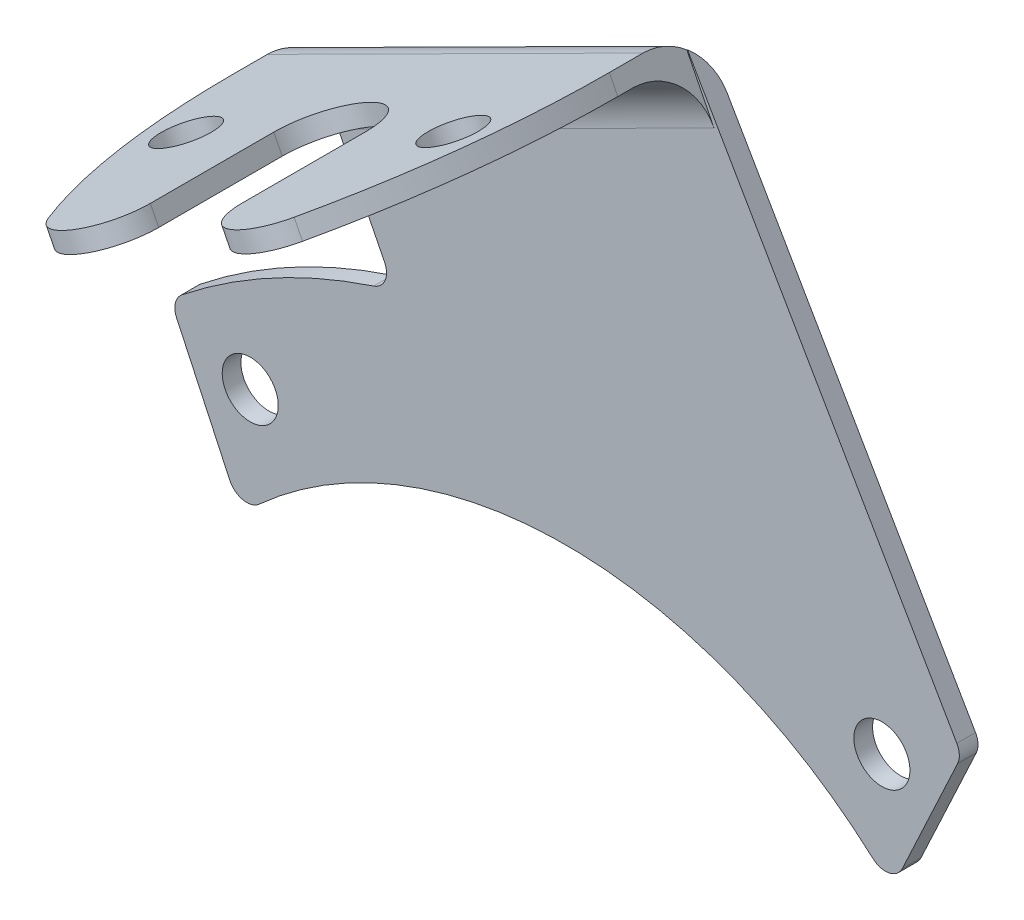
ISO-10303-21;
HEADER;
FILE_DESCRIPTION(('STEP AP214'),'2;1');
FILE_NAME('part.step','',(''),(''),'','','');
FILE_SCHEMA(('AUTOMOTIVE_DESIGN { 1 0 10303 214 1 1 1 1 }'));
ENDSEC;
DATA;
#1=APPLICATION_CONTEXT('core data for automotive mechanical design processes');
#2=APPLICATION_PROTOCOL_DEFINITION('international standard','automotive_design',2000,#1);
#3=PRODUCT_CONTEXT('',#1,'mechanical');
#4=PRODUCT('Part','Part','',(#3));
#5=PRODUCT_RELATED_PRODUCT_CATEGORY('part','',(#4));
#6=PRODUCT_DEFINITION_FORMATION('','',#4);
#7=PRODUCT_DEFINITION_CONTEXT('part definition',#1,'design');
#8=PRODUCT_DEFINITION('design','',#6,#7);
#9=PRODUCT_DEFINITION_SHAPE('','',#8);
#10=(LENGTH_UNIT() NAMED_UNIT(*) SI_UNIT(.MILLI.,.METRE.));
#11=(NAMED_UNIT(*) PLANE_ANGLE_UNIT() SI_UNIT($,.RADIAN.));
#12=(NAMED_UNIT(*) SI_UNIT($,.STERADIAN.) SOLID_ANGLE_UNIT());
#13=UNCERTAINTY_MEASURE_WITH_UNIT(LENGTH_MEASURE(1.E-05),#10,'distance_accuracy_value','');
#14=(GEOMETRIC_REPRESENTATION_CONTEXT(3) GLOBAL_UNCERTAINTY_ASSIGNED_CONTEXT((#13)) GLOBAL_UNIT_ASSIGNED_CONTEXT((#10,
#11,#12)) REPRESENTATION_CONTEXT('',''));
#15=CARTESIAN_POINT('',(0.,0.,0.));
#16=DIRECTION('',(0.,0.,1.));
#17=DIRECTION('',(1.,0.,0.));
#18=AXIS2_PLACEMENT_3D('',#15,#16,#17);
#19=CARTESIAN_POINT('',(-21.2075310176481,64.6083634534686,2.));
#20=DIRECTION('',(0.,0.,1.));
#21=DIRECTION('',(1.,0.,0.));
#22=AXIS2_PLACEMENT_3D('',#19,#20,#21);
#23=PLANE('',#22);
#24=DIRECTION('',(-0.500390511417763,0.865799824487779,0.));
#25=VECTOR('',#24,1.);
#26=CARTESIAN_POINT('',(41.8150128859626,51.534310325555,2.));
#27=LINE('',#26,#25);
#28=CARTESIAN_POINT('',(41.8150128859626,51.534310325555,2.));
#29=VERTEX_POINT('',#28);
#30=CARTESIAN_POINT('',(13.0019709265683,101.388026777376,2.));
#31=VERTEX_POINT('',#30);
#32=EDGE_CURVE('E689',#29,#31,#27,.T.);
#33=ORIENTED_EDGE('',*,*,#32,.T.);
#34=DIRECTION('',(-0.893343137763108,-0.449375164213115,0.));
#35=VECTOR('',#34,1.);
#36=CARTESIAN_POINT('',(13.0019709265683,101.388026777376,2.));
#37=LINE('',#36,#35);
#38=CARTESIAN_POINT('',(12.9227393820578,101.348171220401,2.));
#39=VERTEX_POINT('',#38);
#40=EDGE_CURVE('E756',#31,#39,#37,.T.);
#41=ORIENTED_EDGE('',*,*,#40,.T.);
#42=DIRECTION('',(-0.449375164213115,0.893343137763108,0.));
#43=VECTOR('',#42,1.);
#44=CARTESIAN_POINT('',(13.1349055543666,100.926391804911,2.));
#45=LINE('',#44,#43);
#46=CARTESIAN_POINT('',(15.8311565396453,95.566332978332,2.));
#47=VERTEX_POINT('',#46);
#48=EDGE_CURVE('E391',#47,#39,#45,.T.);
#49=ORIENTED_EDGE('',*,*,#48,.F.);
#50=DIRECTION('',(-0.893343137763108,-0.449375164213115,0.));
#51=VECTOR('',#50,1.);
#52=CARTESIAN_POINT('',(-26.1559709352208,74.4457002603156,2.));
#53=LINE('',#52,#51);
#54=CARTESIAN_POINT('',(-24.3692846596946,75.3444505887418,2.));
#55=VERTEX_POINT('',#54);
#56=EDGE_CURVE('E765',#47,#55,#53,.T.);
#57=ORIENTED_EDGE('',*,*,#56,.T.);
#58=DIRECTION('',(0.449375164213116,-0.893343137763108,0.));
#59=VECTOR('',#58,1.);
#60=CARTESIAN_POINT('',(-27.9642859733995,82.4911956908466,2.));
#61=LINE('',#60,#59);
#62=CARTESIAN_POINT('',(-19.4208447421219,65.5071137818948,2.));
#63=VERTEX_POINT('',#62);
#64=EDGE_CURVE('E646',#55,#63,#61,.T.);
#65=ORIENTED_EDGE('',*,*,#64,.T.);
#66=CARTESIAN_POINT('',(-21.2075310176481,64.6083634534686,2.));
#67=DIRECTION('',(0.,0.,-1.));
#68=DIRECTION('',(1.,0.,0.));
#69=AXIS2_PLACEMENT_3D('',#66,#67,#68);
#70=CIRCLE('',#69,2.00000000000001);
#71=CARTESIAN_POINT('',(-20.5837801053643,62.708117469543,2.));
#72=VERTEX_POINT('',#71);
#73=EDGE_CURVE('E649',#63,#72,#70,.T.);
#74=ORIENTED_EDGE('',*,*,#73,.T.);
#75=CARTESIAN_POINT('',(0.,0.,2.));
#76=DIRECTION('',(0.,0.,1.));
#77=DIRECTION('',(-1.,0.,0.));
#78=AXIS2_PLACEMENT_3D('',#75,#76,#77);
#79=CIRCLE('',#78,66.);
#80=CARTESIAN_POINT('',(-41.1117039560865,51.6316549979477,2.));
#81=VERTEX_POINT('',#80);
#82=EDGE_CURVE('E705',#72,#81,#79,.T.);
#83=ORIENTED_EDGE('',*,*,#82,.T.);
#84=CARTESIAN_POINT('',(-39.865894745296,50.0670593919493,2.));
#85=DIRECTION('',(0.,0.,1.));
#86=DIRECTION('',(1.,0.,0.));
#87=AXIS2_PLACEMENT_3D('',#84,#85,#86);
#88=CIRCLE('',#87,2.);
#89=CARTESIAN_POINT('',(-41.6785103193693,49.2218228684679,2.));
#90=VERTEX_POINT('',#89);
#91=EDGE_CURVE('E704',#81,#90,#88,.T.);
#92=ORIENTED_EDGE('',*,*,#91,.T.);
#93=DIRECTION('',(0.422618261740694,-0.906307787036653,0.));
#94=VECTOR('',#93,1.);
#95=CARTESIAN_POINT('',(-41.6785103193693,49.2218228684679,2.));
#96=LINE('',#95,#94);
#97=CARTESIAN_POINT('',(-35.9853205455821,37.0127379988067,2.));
#98=VERTEX_POINT('',#97);
#99=EDGE_CURVE('E702',#90,#98,#96,.T.);
#100=ORIENTED_EDGE('',*,*,#99,.T.);
#101=CARTESIAN_POINT('',(-34.1727049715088,37.8579745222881,2.));
#102=DIRECTION('',(0.,0.,1.));
#103=DIRECTION('',(-1.,0.,0.));
#104=AXIS2_PLACEMENT_3D('',#101,#102,#103);
#105=CIRCLE('',#104,2.);
#106=CARTESIAN_POINT('',(-32.8325988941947,36.3733480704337,2.));
#107=VERTEX_POINT('',#106);
#108=EDGE_CURVE('E700',#98,#107,#105,.T.);
#109=ORIENTED_EDGE('',*,*,#108,.T.);
#110=CARTESIAN_POINT('',(0.,0.,2.));
#111=DIRECTION('',(0.,0.,-1.));
#112=DIRECTION('',(1.,0.,0.));
#113=AXIS2_PLACEMENT_3D('',#110,#111,#112);
#114=CIRCLE('',#113,49.);
#115=CARTESIAN_POINT('',(32.8325988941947,36.3733480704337,2.));
#116=VERTEX_POINT('',#115);
#117=EDGE_CURVE('E698',#107,#116,#114,.T.);
#118=ORIENTED_EDGE('',*,*,#117,.T.);
#119=CARTESIAN_POINT('',(34.1727049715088,37.8579745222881,2.));
#120=DIRECTION('',(0.,0.,1.));
#121=DIRECTION('',(1.,0.,0.));
#122=AXIS2_PLACEMENT_3D('',#119,#120,#121);
#123=CIRCLE('',#122,2.);
#124=CARTESIAN_POINT('',(35.9853205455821,37.0127379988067,2.));
#125=VERTEX_POINT('',#124);
#126=EDGE_CURVE('E696',#116,#125,#123,.T.);
#127=ORIENTED_EDGE('',*,*,#126,.T.);
#128=DIRECTION('',(0.422618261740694,0.906307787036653,0.));
#129=VECTOR('',#128,1.);
#130=CARTESIAN_POINT('',(41.8960288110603,49.6882927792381,2.));
#131=LINE('',#130,#129);
#132=CARTESIAN_POINT('',(41.8960288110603,49.6882927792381,2.));
#133=VERTEX_POINT('',#132);
#134=EDGE_CURVE('E694',#125,#133,#131,.T.);
#135=ORIENTED_EDGE('',*,*,#134,.T.);
#136=CARTESIAN_POINT('',(40.083413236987,50.5335293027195,2.));
#137=DIRECTION('',(0.,0.,1.));
#138=DIRECTION('',(1.,0.,0.));
#139=AXIS2_PLACEMENT_3D('',#136,#137,#138);
#140=CIRCLE('',#139,2.);
#141=EDGE_CURVE('E692',#133,#29,#140,.T.);
#142=ORIENTED_EDGE('',*,*,#141,.T.);
#143=EDGE_LOOP('',(#33,#41,#49,#57,#65,#74,#83,#92,#100,#109,#118,#127,#135,#142));
#144=FACE_BOUND('',#143,.T.);
#145=CARTESIAN_POINT('',(33.7976520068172,46.5184771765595,2.));
#146=DIRECTION('',(0.,0.,1.));
#147=DIRECTION('',(1.,0.,0.));
#148=AXIS2_PLACEMENT_3D('',#145,#146,#147);
#149=CIRCLE('',#148,3.);
#150=CARTESIAN_POINT('',(36.7976520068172,46.5184771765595,2.));
#151=VERTEX_POINT('',#150);
#152=EDGE_CURVE('E620',#151,#151,#149,.T.);
#153=ORIENTED_EDGE('',*,*,#152,.F.);
#154=EDGE_LOOP('',(#153));
#155=FACE_BOUND('',#154,.T.);
#156=CARTESIAN_POINT('',(-33.7976520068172,46.5184771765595,2.));
#157=DIRECTION('',(0.,0.,1.));
#158=DIRECTION('',(-1.,0.,0.));
#159=AXIS2_PLACEMENT_3D('',#156,#157,#158);
#160=CIRCLE('',#159,3.);
#161=CARTESIAN_POINT('',(-36.7976520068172,46.5184771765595,2.));
#162=VERTEX_POINT('',#161);
#163=EDGE_CURVE('E614',#162,#162,#160,.T.);
#164=ORIENTED_EDGE('',*,*,#163,.F.);
#165=EDGE_LOOP('',(#164));
#166=FACE_BOUND('',#165,.T.);
#167=ADVANCED_FACE('F368',(#144,#155,#166),#23,.T.);
#168=CARTESIAN_POINT('',(-21.2075310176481,64.6083634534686,0.));
#169=DIRECTION('',(0.,0.,1.));
#170=DIRECTION('',(1.,0.,0.));
#171=AXIS2_PLACEMENT_3D('',#168,#169,#170);
#172=PLANE('',#171);
#173=CARTESIAN_POINT('',(33.7976520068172,46.5184771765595,0.));
#174=DIRECTION('',(0.,0.,1.));
#175=DIRECTION('',(1.,0.,0.));
#176=AXIS2_PLACEMENT_3D('',#173,#174,#175);
#177=CIRCLE('',#176,3.);
#178=CARTESIAN_POINT('',(36.7976520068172,46.5184771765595,0.));
#179=VERTEX_POINT('',#178);
#180=EDGE_CURVE('E617',#179,#179,#177,.T.);
#181=ORIENTED_EDGE('',*,*,#180,.T.);
#182=EDGE_LOOP('',(#181));
#183=FACE_BOUND('',#182,.T.);
#184=DIRECTION('',(0.449375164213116,-0.893343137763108,0.));
#185=VECTOR('',#184,1.);
#186=CARTESIAN_POINT('',(-27.9642859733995,82.4911956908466,0.));
#187=LINE('',#186,#185);
#188=CARTESIAN_POINT('',(-25.2680349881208,77.131136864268,0.));
#189=VERTEX_POINT('',#188);
#190=CARTESIAN_POINT('',(-19.4208447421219,65.5071137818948,0.));
#191=VERTEX_POINT('',#190);
#192=EDGE_CURVE('E623',#189,#191,#187,.T.);
#193=ORIENTED_EDGE('',*,*,#192,.F.);
#194=DIRECTION('',(-0.893343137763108,-0.449375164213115,0.));
#195=VECTOR('',#194,1.);
#196=CARTESIAN_POINT('',(-27.054721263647,76.2323865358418,0.));
#197=LINE('',#196,#195);
#198=CARTESIAN_POINT('',(15.2435525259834,97.5095340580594,0.));
#199=VERTEX_POINT('',#198);
#200=EDGE_CURVE('E1018',#189,#199,#197,.F.);
#201=ORIENTED_EDGE('',*,*,#200,.T.);
#202=DIRECTION('',(-0.500390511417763,0.865799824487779,0.));
#203=VECTOR('',#202,1.);
#204=CARTESIAN_POINT('',(41.8150128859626,51.534310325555,0.));
#205=LINE('',#204,#203);
#206=CARTESIAN_POINT('',(41.8150128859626,51.534310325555,0.));
#207=VERTEX_POINT('',#206);
#208=EDGE_CURVE('E643',#207,#199,#205,.T.);
#209=ORIENTED_EDGE('',*,*,#208,.F.);
#210=CARTESIAN_POINT('',(40.083413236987,50.5335293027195,0.));
#211=DIRECTION('',(0.,0.,1.));
#212=DIRECTION('',(1.,0.,0.));
#213=AXIS2_PLACEMENT_3D('',#210,#211,#212);
#214=CIRCLE('',#213,2.);
#215=CARTESIAN_POINT('',(41.8960288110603,49.6882927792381,0.));
#216=VERTEX_POINT('',#215);
#217=EDGE_CURVE('E641',#216,#207,#214,.T.);
#218=ORIENTED_EDGE('',*,*,#217,.F.);
#219=DIRECTION('',(0.422618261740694,0.906307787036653,0.));
#220=VECTOR('',#219,1.);
#221=CARTESIAN_POINT('',(41.8960288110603,49.6882927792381,0.));
#222=LINE('',#221,#220);
#223=CARTESIAN_POINT('',(35.9853205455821,37.0127379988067,0.));
#224=VERTEX_POINT('',#223);
#225=EDGE_CURVE('E639',#224,#216,#222,.T.);
#226=ORIENTED_EDGE('',*,*,#225,.F.);
#227=CARTESIAN_POINT('',(34.1727049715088,37.8579745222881,0.));
#228=DIRECTION('',(0.,0.,1.));
#229=DIRECTION('',(1.,0.,0.));
#230=AXIS2_PLACEMENT_3D('',#227,#228,#229);
#231=CIRCLE('',#230,2.);
#232=CARTESIAN_POINT('',(32.8325988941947,36.3733480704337,0.));
#233=VERTEX_POINT('',#232);
#234=EDGE_CURVE('E637',#233,#224,#231,.T.);
#235=ORIENTED_EDGE('',*,*,#234,.F.);
#236=CARTESIAN_POINT('',(0.,0.,0.));
#237=DIRECTION('',(0.,0.,-1.));
#238=DIRECTION('',(1.,0.,0.));
#239=AXIS2_PLACEMENT_3D('',#236,#237,#238);
#240=CIRCLE('',#239,49.);
#241=CARTESIAN_POINT('',(-32.8325988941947,36.3733480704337,0.));
#242=VERTEX_POINT('',#241);
#243=EDGE_CURVE('E635',#242,#233,#240,.T.);
#244=ORIENTED_EDGE('',*,*,#243,.F.);
#245=CARTESIAN_POINT('',(-34.1727049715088,37.8579745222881,0.));
#246=DIRECTION('',(0.,0.,1.));
#247=DIRECTION('',(-1.,0.,0.));
#248=AXIS2_PLACEMENT_3D('',#245,#246,#247);
#249=CIRCLE('',#248,2.);
#250=CARTESIAN_POINT('',(-35.9853205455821,37.0127379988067,0.));
#251=VERTEX_POINT('',#250);
#252=EDGE_CURVE('E633',#251,#242,#249,.T.);
#253=ORIENTED_EDGE('',*,*,#252,.F.);
#254=DIRECTION('',(0.422618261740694,-0.906307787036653,0.));
#255=VECTOR('',#254,1.);
#256=CARTESIAN_POINT('',(-41.6785103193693,49.2218228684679,0.));
#257=LINE('',#256,#255);
#258=CARTESIAN_POINT('',(-41.6785103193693,49.2218228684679,0.));
#259=VERTEX_POINT('',#258);
#260=EDGE_CURVE('E631',#259,#251,#257,.T.);
#261=ORIENTED_EDGE('',*,*,#260,.F.);
#262=CARTESIAN_POINT('',(-39.865894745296,50.0670593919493,0.));
#263=DIRECTION('',(0.,0.,1.));
#264=DIRECTION('',(1.,0.,0.));
#265=AXIS2_PLACEMENT_3D('',#262,#263,#264);
#266=CIRCLE('',#265,2.);
#267=CARTESIAN_POINT('',(-41.1117039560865,51.6316549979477,0.));
#268=VERTEX_POINT('',#267);
#269=EDGE_CURVE('E629',#268,#259,#266,.T.);
#270=ORIENTED_EDGE('',*,*,#269,.F.);
#271=CARTESIAN_POINT('',(0.,0.,0.));
#272=DIRECTION('',(0.,0.,1.));
#273=DIRECTION('',(-1.,0.,0.));
#274=AXIS2_PLACEMENT_3D('',#271,#272,#273);
#275=CIRCLE('',#274,66.);
#276=CARTESIAN_POINT('',(-20.5837801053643,62.708117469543,0.));
#277=VERTEX_POINT('',#276);
#278=EDGE_CURVE('E627',#277,#268,#275,.T.);
#279=ORIENTED_EDGE('',*,*,#278,.F.);
#280=CARTESIAN_POINT('',(-21.2075310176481,64.6083634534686,0.));
#281=DIRECTION('',(0.,0.,-1.));
#282=DIRECTION('',(1.,0.,0.));
#283=AXIS2_PLACEMENT_3D('',#280,#281,#282);
#284=CIRCLE('',#283,2.00000000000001);
#285=EDGE_CURVE('E625',#191,#277,#284,.T.);
#286=ORIENTED_EDGE('',*,*,#285,.F.);
#287=EDGE_LOOP('',(#193,#201,#209,#218,#226,#235,#244,#253,#261,#270,#279,#286));
#288=FACE_BOUND('',#287,.T.);
#289=CARTESIAN_POINT('',(-33.7976520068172,46.5184771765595,0.));
#290=DIRECTION('',(0.,0.,1.));
#291=DIRECTION('',(-1.,0.,0.));
#292=AXIS2_PLACEMENT_3D('',#289,#290,#291);
#293=CIRCLE('',#292,3.);
#294=CARTESIAN_POINT('',(-36.7976520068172,46.5184771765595,0.));
#295=VERTEX_POINT('',#294);
#296=EDGE_CURVE('E598',#295,#295,#293,.T.);
#297=ORIENTED_EDGE('',*,*,#296,.T.);
#298=EDGE_LOOP('',(#297));
#299=FACE_BOUND('',#298,.T.);
#300=ADVANCED_FACE('F813',(#183,#288,#299),#172,.F.);
#301=CARTESIAN_POINT('',(12.2361552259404,102.713078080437,2.));
#302=DIRECTION('',(0.449375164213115,-0.893343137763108,0.));
#303=DIRECTION('',(0.893343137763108,0.449375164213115,0.));
#304=AXIS2_PLACEMENT_3D('',#301,#302,#303);
#305=PLANE('',#304);
#306=DIRECTION('',(0.,0.,-1.));
#307=VECTOR('',#306,1.);
#308=CARTESIAN_POINT('',(12.2361552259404,102.713078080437,2.));
#309=LINE('',#308,#307);
#310=CARTESIAN_POINT('',(12.2361552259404,102.713078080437,9.6027526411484));
#311=VERTEX_POINT('',#310);
#312=CARTESIAN_POINT('',(12.2361552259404,102.713078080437,6.));
#313=VERTEX_POINT('',#312);
#314=EDGE_CURVE('E574',#311,#313,#309,.T.);
#315=ORIENTED_EDGE('',*,*,#314,.T.);
#316=DIRECTION('',(-0.893343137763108,-0.449375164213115,0.));
#317=VECTOR('',#316,1.);
#318=CARTESIAN_POINT('',(12.2361552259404,102.713078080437,6.));
#319=LINE('',#318,#317);
#320=CARTESIAN_POINT('',(-27.9642859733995,82.4911956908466,6.));
#321=VERTEX_POINT('',#320);
#322=EDGE_CURVE('E534',#313,#321,#319,.T.);
#323=ORIENTED_EDGE('',*,*,#322,.T.);
#324=DIRECTION('',(0.,0.,-1.));
#325=VECTOR('',#324,1.);
#326=CARTESIAN_POINT('',(-27.9642859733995,82.4911956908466,2.));
#327=LINE('',#326,#325);
#328=CARTESIAN_POINT('',(-27.9642859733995,82.4911956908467,9.60275264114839));
#329=VERTEX_POINT('',#328);
#330=EDGE_CURVE('E526',#329,#321,#327,.T.);
#331=ORIENTED_EDGE('',*,*,#330,.F.);
#332=CARTESIAN_POINT('',(16.7028709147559,104.959953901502,9.60275264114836));
#333=DIRECTION('',(-0.449375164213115,0.893343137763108,0.));
#334=DIRECTION('',(0.893343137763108,0.449375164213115,0.));
#335=AXIS2_PLACEMENT_3D('',#332,#333,#334);
#336=CIRCLE('',#335,50.);
#337=CARTESIAN_POINT('',(-21.0160615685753,85.9863358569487,36.3849099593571));
#338=VERTEX_POINT('',#337);
#339=EDGE_CURVE('E532',#329,#338,#336,.T.);
#340=ORIENTED_EDGE('',*,*,#339,.T.);
#341=CARTESIAN_POINT('',(-17.2441683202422,87.8836976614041,33.7066942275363));
#342=DIRECTION('',(-0.449375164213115,0.893343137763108,0.));
#343=DIRECTION('',(0.893343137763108,0.449375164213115,0.));
#344=AXIS2_PLACEMENT_3D('',#341,#342,#343);
#345=CIRCLE('',#344,5.);
#346=CARTESIAN_POINT('',(-12.7774526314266,90.1305734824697,33.7066942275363));
#347=VERTEX_POINT('',#346);
#348=EDGE_CURVE('E550',#338,#347,#345,.T.);
#349=ORIENTED_EDGE('',*,*,#348,.T.);
#350=DIRECTION('',(0.,0.,-1.));
#351=VECTOR('',#350,1.);
#352=CARTESIAN_POINT('',(-12.7774526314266,90.1305734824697,33.7066942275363));
#353=LINE('',#352,#351);
#354=CARTESIAN_POINT('',(-12.7774526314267,90.1305734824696,20.5));
#355=VERTEX_POINT('',#354);
#356=EDGE_CURVE('E553',#347,#355,#353,.T.);
#357=ORIENTED_EDGE('',*,*,#356,.T.);
#358=CARTESIAN_POINT('',(-7.86406537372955,92.6021368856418,20.5));
#359=DIRECTION('',(0.449375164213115,-0.893343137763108,0.));
#360=DIRECTION('',(-0.893343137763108,-0.449375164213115,0.));
#361=AXIS2_PLACEMENT_3D('',#358,#359,#360);
#362=CIRCLE('',#361,5.50000000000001);
#363=CARTESIAN_POINT('',(-2.95067811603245,95.0737002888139,20.5));
#364=VERTEX_POINT('',#363);
#365=EDGE_CURVE('E562',#355,#364,#362,.T.);
#366=ORIENTED_EDGE('',*,*,#365,.T.);
#367=DIRECTION('',(0.,0.,1.));
#368=VECTOR('',#367,1.);
#369=CARTESIAN_POINT('',(-2.95067811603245,95.0737002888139,33.7066942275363));
#370=LINE('',#369,#368);
#371=CARTESIAN_POINT('',(-2.95067811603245,95.0737002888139,33.7066942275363));
#372=VERTEX_POINT('',#371);
#373=EDGE_CURVE('E565',#364,#372,#370,.T.);
#374=ORIENTED_EDGE('',*,*,#373,.T.);
#375=CARTESIAN_POINT('',(1.51603757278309,97.3205761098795,33.7066942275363));
#376=DIRECTION('',(-0.449375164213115,0.893343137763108,0.));
#377=DIRECTION('',(-0.893343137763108,-0.449375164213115,0.));
#378=AXIS2_PLACEMENT_3D('',#375,#376,#377);
#379=CIRCLE('',#378,5.);
#380=CARTESIAN_POINT('',(5.28793082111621,99.2179379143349,36.3849099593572));
#381=VERTEX_POINT('',#380);
#382=EDGE_CURVE('E568',#372,#381,#379,.T.);
#383=ORIENTED_EDGE('',*,*,#382,.T.);
#384=CARTESIAN_POINT('',(-32.431001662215,80.2443198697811,9.60275264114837));
#385=DIRECTION('',(-0.449375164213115,0.893343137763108,0.));
#386=DIRECTION('',(-0.893343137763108,-0.449375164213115,0.));
#387=AXIS2_PLACEMENT_3D('',#384,#385,#386);
#388=CIRCLE('',#387,50.);
#389=EDGE_CURVE('E571',#381,#311,#388,.T.);
#390=ORIENTED_EDGE('',*,*,#389,.T.);
#391=EDGE_LOOP('',(#315,#323,#331,#340,#349,#357,#366,#374,#383,#390));
#392=FACE_BOUND('',#391,.T.);
#393=CARTESIAN_POINT('',(-22.1575555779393,85.4121342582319,20.5));
#394=DIRECTION('',(-0.449375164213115,0.893343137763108,0.));
#395=DIRECTION('',(0.893343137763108,0.449375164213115,0.));
#396=AXIS2_PLACEMENT_3D('',#393,#394,#395);
#397=CIRCLE('',#396,3.);
#398=CARTESIAN_POINT('',(-19.47752616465,86.7602597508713,20.5));
#399=VERTEX_POINT('',#398);
#400=EDGE_CURVE('E993',#399,#399,#397,.T.);
#401=ORIENTED_EDGE('',*,*,#400,.F.);
#402=EDGE_LOOP('',(#401));
#403=FACE_BOUND('',#402,.T.);
#404=CARTESIAN_POINT('',(6.42942483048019,99.7921395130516,20.5));
#405=DIRECTION('',(-0.449375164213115,0.893343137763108,0.));
#406=DIRECTION('',(-0.893343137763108,-0.449375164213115,0.));
#407=AXIS2_PLACEMENT_3D('',#404,#405,#406);
#408=CIRCLE('',#407,3.00000000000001);
#409=CARTESIAN_POINT('',(3.74939541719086,98.4440140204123,20.5));
#410=VERTEX_POINT('',#409);
#411=EDGE_CURVE('E556',#410,#410,#408,.T.);
#412=ORIENTED_EDGE('',*,*,#411,.F.);
#413=EDGE_LOOP('',(#412));
#414=FACE_BOUND('',#413,.T.);
#415=ADVANCED_FACE('F370',(#392,#403,#414),#305,.F.);
#416=CARTESIAN_POINT('',(-27.9642859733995,82.4911956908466,2.));
#417=DIRECTION('',(0.893343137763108,0.449375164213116,0.));
#418=DIRECTION('',(-0.449375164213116,0.893343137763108,0.));
#419=AXIS2_PLACEMENT_3D('',#416,#417,#418);
#420=PLANE('',#419);
#421=ORIENTED_EDGE('',*,*,#330,.T.);
#422=CARTESIAN_POINT('',(-25.2680349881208,77.131136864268,6.));
#423=DIRECTION('',(0.893343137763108,0.449375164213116,0.));
#424=DIRECTION('',(-0.449375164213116,0.893343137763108,0.));
#425=AXIS2_PLACEMENT_3D('',#422,#423,#424);
#426=CIRCLE('',#425,6.);
#427=EDGE_CURVE('E656',#321,#189,#426,.F.);
#428=ORIENTED_EDGE('',*,*,#427,.T.);
#429=ORIENTED_EDGE('',*,*,#192,.T.);
#430=DIRECTION('',(0.,0.,-1.));
#431=VECTOR('',#430,1.);
#432=CARTESIAN_POINT('',(-19.4208447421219,65.5071137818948,2.));
#433=LINE('',#432,#431);
#434=EDGE_CURVE('E536',#63,#191,#433,.T.);
#435=ORIENTED_EDGE('',*,*,#434,.F.);
#436=ORIENTED_EDGE('',*,*,#64,.F.);
#437=CARTESIAN_POINT('',(-24.3692846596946,75.3444505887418,8.));
#438=DIRECTION('',(0.893343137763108,0.449375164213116,0.));
#439=DIRECTION('',(-0.449375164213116,0.893343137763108,0.));
#440=AXIS2_PLACEMENT_3D('',#437,#438,#439);
#441=CIRCLE('',#440,6.);
#442=CARTESIAN_POINT('',(-27.0655356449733,80.7045094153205,8.));
#443=VERTEX_POINT('',#442);
#444=EDGE_CURVE('E376',#55,#443,#441,.T.);
#445=ORIENTED_EDGE('',*,*,#444,.T.);
#446=DIRECTION('',(0.,0.,1.));
#447=VECTOR('',#446,1.);
#448=CARTESIAN_POINT('',(-27.0655356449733,80.7045094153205,2.));
#449=LINE('',#448,#447);
#450=CARTESIAN_POINT('',(-27.0655356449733,80.7045094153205,9.60275264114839));
#451=VERTEX_POINT('',#450);
#452=EDGE_CURVE('E541',#443,#451,#449,.T.);
#453=ORIENTED_EDGE('',*,*,#452,.T.);
#454=DIRECTION('',(-0.449375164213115,0.893343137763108,0.));
#455=VECTOR('',#454,1.);
#456=CARTESIAN_POINT('',(-27.0655356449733,80.7045094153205,9.60275264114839));
#457=LINE('',#456,#455);
#458=EDGE_CURVE('E539',#451,#329,#457,.T.);
#459=ORIENTED_EDGE('',*,*,#458,.T.);
#460=EDGE_LOOP('',(#421,#428,#429,#435,#436,#445,#453,#459));
#461=FACE_BOUND('',#460,.T.);
#462=ADVANCED_FACE('F540',(#461),#420,.F.);
#463=CARTESIAN_POINT('',(-21.2075310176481,64.6083634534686,2.));
#464=DIRECTION('',(0.,0.,-1.));
#465=DIRECTION('',(-1.,0.,0.));
#466=AXIS2_PLACEMENT_3D('',#463,#464,#465);
#467=CYLINDRICAL_SURFACE('',#466,2.00000000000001);
#468=ORIENTED_EDGE('',*,*,#285,.T.);
#469=DIRECTION('',(0.,0.,-1.));
#470=VECTOR('',#469,1.);
#471=CARTESIAN_POINT('',(-20.5837801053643,62.708117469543,2.));
#472=LINE('',#471,#470);
#473=EDGE_CURVE('E662',#72,#277,#472,.T.);
#474=ORIENTED_EDGE('',*,*,#473,.F.);
#475=ORIENTED_EDGE('',*,*,#73,.F.);
#476=ORIENTED_EDGE('',*,*,#434,.T.);
#477=EDGE_LOOP('',(#468,#474,#475,#476));
#478=FACE_BOUND('',#477,.T.);
#479=ADVANCED_FACE('F714',(#478),#467,.F.);
#480=CARTESIAN_POINT('',(0.,0.,2.));
#481=DIRECTION('',(0.,0.,-1.));
#482=DIRECTION('',(-1.,0.,0.));
#483=AXIS2_PLACEMENT_3D('',#480,#481,#482);
#484=CYLINDRICAL_SURFACE('',#483,66.);
#485=ORIENTED_EDGE('',*,*,#278,.T.);
#486=DIRECTION('',(0.,0.,-1.));
#487=VECTOR('',#486,1.);
#488=CARTESIAN_POINT('',(-41.1117039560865,51.6316549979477,2.));
#489=LINE('',#488,#487);
#490=EDGE_CURVE('E665',#81,#268,#489,.T.);
#491=ORIENTED_EDGE('',*,*,#490,.F.);
#492=ORIENTED_EDGE('',*,*,#82,.F.);
#493=ORIENTED_EDGE('',*,*,#473,.T.);
#494=EDGE_LOOP('',(#485,#491,#492,#493));
#495=FACE_BOUND('',#494,.T.);
#496=ADVANCED_FACE('F718',(#495),#484,.T.);
#497=CARTESIAN_POINT('',(-39.865894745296,50.0670593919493,2.));
#498=DIRECTION('',(0.,0.,-1.));
#499=DIRECTION('',(-1.,0.,0.));
#500=AXIS2_PLACEMENT_3D('',#497,#498,#499);
#501=CYLINDRICAL_SURFACE('',#500,2.);
#502=ORIENTED_EDGE('',*,*,#269,.T.);
#503=DIRECTION('',(0.,0.,-1.));
#504=VECTOR('',#503,1.);
#505=CARTESIAN_POINT('',(-41.6785103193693,49.2218228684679,2.));
#506=LINE('',#505,#504);
#507=EDGE_CURVE('E668',#90,#259,#506,.T.);
#508=ORIENTED_EDGE('',*,*,#507,.F.);
#509=ORIENTED_EDGE('',*,*,#91,.F.);
#510=ORIENTED_EDGE('',*,*,#490,.T.);
#511=EDGE_LOOP('',(#502,#508,#509,#510));
#512=FACE_BOUND('',#511,.T.);
#513=ADVANCED_FACE('F723',(#512),#501,.T.);
#514=CARTESIAN_POINT('',(-41.6785103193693,49.2218228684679,2.));
#515=DIRECTION('',(0.906307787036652,0.422618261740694,0.));
#516=DIRECTION('',(-0.422618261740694,0.906307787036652,0.));
#517=AXIS2_PLACEMENT_3D('',#514,#515,#516);
#518=PLANE('',#517);
#519=ORIENTED_EDGE('',*,*,#260,.T.);
#520=DIRECTION('',(0.,0.,-1.));
#521=VECTOR('',#520,1.);
#522=CARTESIAN_POINT('',(-35.9853205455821,37.0127379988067,2.));
#523=LINE('',#522,#521);
#524=EDGE_CURVE('E671',#98,#251,#523,.T.);
#525=ORIENTED_EDGE('',*,*,#524,.F.);
#526=ORIENTED_EDGE('',*,*,#99,.F.);
#527=ORIENTED_EDGE('',*,*,#507,.T.);
#528=EDGE_LOOP('',(#519,#525,#526,#527));
#529=FACE_BOUND('',#528,.T.);
#530=ADVANCED_FACE('F729',(#529),#518,.F.);
#531=CARTESIAN_POINT('',(-34.1727049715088,37.8579745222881,2.));
#532=DIRECTION('',(0.,0.,-1.));
#533=DIRECTION('',(-1.,0.,0.));
#534=AXIS2_PLACEMENT_3D('',#531,#532,#533);
#535=CYLINDRICAL_SURFACE('',#534,2.);
#536=ORIENTED_EDGE('',*,*,#252,.T.);
#537=DIRECTION('',(0.,0.,-1.));
#538=VECTOR('',#537,1.);
#539=CARTESIAN_POINT('',(-32.8325988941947,36.3733480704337,2.));
#540=LINE('',#539,#538);
#541=EDGE_CURVE('E674',#107,#242,#540,.T.);
#542=ORIENTED_EDGE('',*,*,#541,.F.);
#543=ORIENTED_EDGE('',*,*,#108,.F.);
#544=ORIENTED_EDGE('',*,*,#524,.T.);
#545=EDGE_LOOP('',(#536,#542,#543,#544));
#546=FACE_BOUND('',#545,.T.);
#547=ADVANCED_FACE('F733',(#546),#535,.T.);
#548=CARTESIAN_POINT('',(0.,0.,2.));
#549=DIRECTION('',(0.,0.,-1.));
#550=DIRECTION('',(-1.,0.,0.));
#551=AXIS2_PLACEMENT_3D('',#548,#549,#550);
#552=CYLINDRICAL_SURFACE('',#551,49.);
#553=ORIENTED_EDGE('',*,*,#243,.T.);
#554=DIRECTION('',(0.,0.,-1.));
#555=VECTOR('',#554,1.);
#556=CARTESIAN_POINT('',(32.8325988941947,36.3733480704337,2.));
#557=LINE('',#556,#555);
#558=EDGE_CURVE('E677',#116,#233,#557,.T.);
#559=ORIENTED_EDGE('',*,*,#558,.F.);
#560=ORIENTED_EDGE('',*,*,#117,.F.);
#561=ORIENTED_EDGE('',*,*,#541,.T.);
#562=EDGE_LOOP('',(#553,#559,#560,#561));
#563=FACE_BOUND('',#562,.T.);
#564=ADVANCED_FACE('F738',(#563),#552,.F.);
#565=CARTESIAN_POINT('',(34.1727049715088,37.8579745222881,2.));
#566=DIRECTION('',(0.,0.,-1.));
#567=DIRECTION('',(-1.,0.,0.));
#568=AXIS2_PLACEMENT_3D('',#565,#566,#567);
#569=CYLINDRICAL_SURFACE('',#568,2.);
#570=ORIENTED_EDGE('',*,*,#234,.T.);
#571=DIRECTION('',(0.,0.,-1.));
#572=VECTOR('',#571,1.);
#573=CARTESIAN_POINT('',(35.9853205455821,37.0127379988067,2.));
#574=LINE('',#573,#572);
#575=EDGE_CURVE('E680',#125,#224,#574,.T.);
#576=ORIENTED_EDGE('',*,*,#575,.F.);
#577=ORIENTED_EDGE('',*,*,#126,.F.);
#578=ORIENTED_EDGE('',*,*,#558,.T.);
#579=EDGE_LOOP('',(#570,#576,#577,#578));
#580=FACE_BOUND('',#579,.T.);
#581=ADVANCED_FACE('F744',(#580),#569,.T.);
#582=CARTESIAN_POINT('',(41.8960288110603,49.6882927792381,2.));
#583=DIRECTION('',(-0.906307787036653,0.422618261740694,0.));
#584=DIRECTION('',(-0.422618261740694,-0.906307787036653,0.));
#585=AXIS2_PLACEMENT_3D('',#582,#583,#584);
#586=PLANE('',#585);
#587=ORIENTED_EDGE('',*,*,#225,.T.);
#588=DIRECTION('',(0.,0.,-1.));
#589=VECTOR('',#588,1.);
#590=CARTESIAN_POINT('',(41.8960288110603,49.6882927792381,2.));
#591=LINE('',#590,#589);
#592=EDGE_CURVE('E683',#133,#216,#591,.T.);
#593=ORIENTED_EDGE('',*,*,#592,.F.);
#594=ORIENTED_EDGE('',*,*,#134,.F.);
#595=ORIENTED_EDGE('',*,*,#575,.T.);
#596=EDGE_LOOP('',(#587,#593,#594,#595));
#597=FACE_BOUND('',#596,.T.);
#598=ADVANCED_FACE('F748',(#597),#586,.F.);
#599=CARTESIAN_POINT('',(40.083413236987,50.5335293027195,2.));
#600=DIRECTION('',(0.,0.,-1.));
#601=DIRECTION('',(-1.,0.,0.));
#602=AXIS2_PLACEMENT_3D('',#599,#600,#601);
#603=CYLINDRICAL_SURFACE('',#602,2.);
#604=ORIENTED_EDGE('',*,*,#217,.T.);
#605=DIRECTION('',(0.,0.,-1.));
#606=VECTOR('',#605,1.);
#607=CARTESIAN_POINT('',(41.8150128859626,51.534310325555,2.));
#608=LINE('',#607,#606);
#609=EDGE_CURVE('E686',#29,#207,#608,.T.);
#610=ORIENTED_EDGE('',*,*,#609,.F.);
#611=ORIENTED_EDGE('',*,*,#141,.F.);
#612=ORIENTED_EDGE('',*,*,#592,.T.);
#613=EDGE_LOOP('',(#604,#610,#611,#612));
#614=FACE_BOUND('',#613,.T.);
#615=ADVANCED_FACE('F753',(#614),#603,.T.);
#616=CARTESIAN_POINT('',(41.8150128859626,51.534310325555,2.));
#617=DIRECTION('',(-0.865799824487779,-0.500390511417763,0.));
#618=DIRECTION('',(0.500390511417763,-0.865799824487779,0.));
#619=AXIS2_PLACEMENT_3D('',#616,#617,#618);
#620=PLANE('',#619);
#621=ORIENTED_EDGE('',*,*,#208,.T.);
#622=CARTESIAN_POINT('',(15.2435525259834,97.5095340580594,6.));
#623=DIRECTION('',(-0.865799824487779,-0.500390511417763,0.));
#624=DIRECTION('',(-0.500390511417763,0.865799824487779,0.));
#625=AXIS2_PLACEMENT_3D('',#622,#623,#624);
#626=ELLIPSE('',#625,6.01010057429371,6.);
#627=EDGE_CURVE('E763',#199,#31,#626,.F.);
#628=ORIENTED_EDGE('',*,*,#627,.T.);
#629=ORIENTED_EDGE('',*,*,#32,.F.);
#630=ORIENTED_EDGE('',*,*,#609,.T.);
#631=EDGE_LOOP('',(#621,#628,#629,#630));
#632=FACE_BOUND('',#631,.T.);
#633=ADVANCED_FACE('F823',(#632),#620,.F.);
#634=CARTESIAN_POINT('',(33.7976520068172,46.5184771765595,2.));
#635=DIRECTION('',(0.,0.,-1.));
#636=DIRECTION('',(-1.,0.,0.));
#637=AXIS2_PLACEMENT_3D('',#634,#635,#636);
#638=CYLINDRICAL_SURFACE('',#637,3.);
#639=ORIENTED_EDGE('',*,*,#152,.T.);
#640=EDGE_LOOP('',(#639));
#641=FACE_BOUND('',#640,.T.);
#642=ORIENTED_EDGE('',*,*,#180,.F.);
#643=EDGE_LOOP('',(#642));
#644=FACE_BOUND('',#643,.T.);
#645=ADVANCED_FACE('F826',(#641,#644),#638,.F.);
#646=CARTESIAN_POINT('',(-33.7976520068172,46.5184771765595,2.));
#647=DIRECTION('',(0.,0.,-1.));
#648=DIRECTION('',(-1.,0.,0.));
#649=AXIS2_PLACEMENT_3D('',#646,#647,#648);
#650=CYLINDRICAL_SURFACE('',#649,3.);
#651=ORIENTED_EDGE('',*,*,#163,.T.);
#652=EDGE_LOOP('',(#651));
#653=FACE_BOUND('',#652,.T.);
#654=ORIENTED_EDGE('',*,*,#296,.F.);
#655=EDGE_LOOP('',(#654));
#656=FACE_BOUND('',#655,.T.);
#657=ADVANCED_FACE('F810',(#653,#656),#650,.F.);
#658=CARTESIAN_POINT('',(13.1349055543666,100.926391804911,2.));
#659=DIRECTION('',(0.893343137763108,0.449375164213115,0.));
#660=DIRECTION('',(-0.449375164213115,0.893343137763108,0.));
#661=AXIS2_PLACEMENT_3D('',#658,#659,#660);
#662=PLANE('',#661);
#663=ORIENTED_EDGE('',*,*,#48,.T.);
#664=CARTESIAN_POINT('',(14.9324062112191,97.3530192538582,6.));
#665=DIRECTION('',(0.893343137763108,0.449375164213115,0.));
#666=DIRECTION('',(-0.449375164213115,0.893343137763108,0.));
#667=AXIS2_PLACEMENT_3D('',#664,#665,#666);
#668=CIRCLE('',#667,6.);
#669=EDGE_CURVE('E764',#39,#313,#668,.T.);
#670=ORIENTED_EDGE('',*,*,#669,.T.);
#671=ORIENTED_EDGE('',*,*,#314,.F.);
#672=DIRECTION('',(-0.449375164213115,0.893343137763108,0.));
#673=VECTOR('',#672,1.);
#674=CARTESIAN_POINT('',(13.1349055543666,100.926391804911,9.6027526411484));
#675=LINE('',#674,#673);
#676=CARTESIAN_POINT('',(13.1349055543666,100.926391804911,9.6027526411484));
#677=VERTEX_POINT('',#676);
#678=EDGE_CURVE('E599',#677,#311,#675,.T.);
#679=ORIENTED_EDGE('',*,*,#678,.F.);
#680=DIRECTION('',(0.,0.,-1.));
#681=VECTOR('',#680,1.);
#682=CARTESIAN_POINT('',(13.1349055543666,100.926391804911,2.));
#683=LINE('',#682,#681);
#684=CARTESIAN_POINT('',(13.1349055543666,100.926391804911,8.));
#685=VERTEX_POINT('',#684);
#686=EDGE_CURVE('E546',#677,#685,#683,.T.);
#687=ORIENTED_EDGE('',*,*,#686,.T.);
#688=CARTESIAN_POINT('',(15.8311565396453,95.566332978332,8.));
#689=DIRECTION('',(0.893343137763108,0.449375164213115,0.));
#690=DIRECTION('',(-0.449375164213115,0.893343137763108,0.));
#691=AXIS2_PLACEMENT_3D('',#688,#689,#690);
#692=CIRCLE('',#691,6.);
#693=EDGE_CURVE('E11',#685,#47,#692,.F.);
#694=ORIENTED_EDGE('',*,*,#693,.T.);
#695=EDGE_LOOP('',(#663,#670,#671,#679,#687,#694));
#696=FACE_BOUND('',#695,.T.);
#697=ADVANCED_FACE('F778',(#696),#662,.T.);
#698=CARTESIAN_POINT('',(-31.5322513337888,78.4576335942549,9.60275264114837));
#699=DIRECTION('',(-0.449375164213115,0.893343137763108,0.));
#700=DIRECTION('',(-0.893343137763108,-0.449375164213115,0.));
#701=AXIS2_PLACEMENT_3D('',#698,#699,#700);
#702=CYLINDRICAL_SURFACE('',#701,50.);
#703=ORIENTED_EDGE('',*,*,#389,.F.);
#704=DIRECTION('',(-0.449375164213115,0.893343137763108,0.));
#705=VECTOR('',#704,1.);
#706=CARTESIAN_POINT('',(6.18668114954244,97.4312516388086,36.3849099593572));
#707=LINE('',#706,#705);
#708=CARTESIAN_POINT('',(6.18668114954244,97.4312516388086,36.3849099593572));
#709=VERTEX_POINT('',#708);
#710=EDGE_CURVE('E601',#709,#381,#707,.T.);
#711=ORIENTED_EDGE('',*,*,#710,.F.);
#712=CARTESIAN_POINT('',(-31.5322513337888,78.4576335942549,9.60275264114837));
#713=DIRECTION('',(-0.449375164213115,0.893343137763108,0.));
#714=DIRECTION('',(-0.893343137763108,-0.449375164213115,0.));
#715=AXIS2_PLACEMENT_3D('',#712,#713,#714);
#716=CIRCLE('',#715,50.);
#717=EDGE_CURVE('E593',#709,#677,#716,.T.);
#718=ORIENTED_EDGE('',*,*,#717,.T.);
#719=ORIENTED_EDGE('',*,*,#678,.T.);
#720=EDGE_LOOP('',(#703,#711,#718,#719));
#721=FACE_BOUND('',#720,.T.);
#722=ADVANCED_FACE('F801',(#721),#702,.T.);
#723=CARTESIAN_POINT('',(2.41478790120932,95.5338898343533,33.7066942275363));
#724=DIRECTION('',(-0.449375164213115,0.893343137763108,0.));
#725=DIRECTION('',(-0.893343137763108,-0.449375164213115,0.));
#726=AXIS2_PLACEMENT_3D('',#723,#724,#725);
#727=CYLINDRICAL_SURFACE('',#726,5.);
#728=ORIENTED_EDGE('',*,*,#382,.F.);
#729=DIRECTION('',(-0.449375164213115,0.893343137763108,0.));
#730=VECTOR('',#729,1.);
#731=CARTESIAN_POINT('',(-2.05192778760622,93.2870140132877,33.7066942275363));
#732=LINE('',#731,#730);
#733=CARTESIAN_POINT('',(-2.05192778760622,93.2870140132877,33.7066942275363));
#734=VERTEX_POINT('',#733);
#735=EDGE_CURVE('E603',#734,#372,#732,.T.);
#736=ORIENTED_EDGE('',*,*,#735,.F.);
#737=CARTESIAN_POINT('',(2.41478790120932,95.5338898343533,33.7066942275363));
#738=DIRECTION('',(-0.449375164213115,0.893343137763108,0.));
#739=DIRECTION('',(-0.893343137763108,-0.449375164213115,0.));
#740=AXIS2_PLACEMENT_3D('',#737,#738,#739);
#741=CIRCLE('',#740,5.);
#742=EDGE_CURVE('E590',#734,#709,#741,.T.);
#743=ORIENTED_EDGE('',*,*,#742,.T.);
#744=ORIENTED_EDGE('',*,*,#710,.T.);
#745=EDGE_LOOP('',(#728,#736,#743,#744));
#746=FACE_BOUND('',#745,.T.);
#747=ADVANCED_FACE('F786',(#746),#727,.T.);
#748=CARTESIAN_POINT('',(-2.05192778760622,93.2870140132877,33.7066942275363));
#749=DIRECTION('',(-0.893343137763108,-0.449375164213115,0.));
#750=DIRECTION('',(0.449375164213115,-0.893343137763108,0.));
#751=AXIS2_PLACEMENT_3D('',#748,#749,#750);
#752=PLANE('',#751);
#753=ORIENTED_EDGE('',*,*,#373,.F.);
#754=DIRECTION('',(-0.449375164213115,0.893343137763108,0.));
#755=VECTOR('',#754,1.);
#756=CARTESIAN_POINT('',(-2.05192778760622,93.2870140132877,20.5));
#757=LINE('',#756,#755);
#758=CARTESIAN_POINT('',(-2.05192778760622,93.2870140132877,20.5));
#759=VERTEX_POINT('',#758);
#760=EDGE_CURVE('E605',#759,#364,#757,.T.);
#761=ORIENTED_EDGE('',*,*,#760,.F.);
#762=DIRECTION('',(0.,0.,1.));
#763=VECTOR('',#762,1.);
#764=CARTESIAN_POINT('',(-2.05192778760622,93.2870140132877,33.7066942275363));
#765=LINE('',#764,#763);
#766=EDGE_CURVE('E587',#759,#734,#765,.T.);
#767=ORIENTED_EDGE('',*,*,#766,.T.);
#768=ORIENTED_EDGE('',*,*,#735,.T.);
#769=EDGE_LOOP('',(#753,#761,#767,#768));
#770=FACE_BOUND('',#769,.T.);
#771=ADVANCED_FACE('F790',(#770),#752,.T.);
#772=CARTESIAN_POINT('',(-6.96531504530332,90.8154506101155,20.5));
#773=DIRECTION('',(-0.449375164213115,0.893343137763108,0.));
#774=DIRECTION('',(-0.893343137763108,-0.449375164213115,0.));
#775=AXIS2_PLACEMENT_3D('',#772,#773,#774);
#776=CYLINDRICAL_SURFACE('',#775,5.50000000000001);
#777=ORIENTED_EDGE('',*,*,#365,.F.);
#778=DIRECTION('',(-0.449375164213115,0.893343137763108,0.));
#779=VECTOR('',#778,1.);
#780=CARTESIAN_POINT('',(-11.8787023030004,88.3438872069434,20.5));
#781=LINE('',#780,#779);
#782=CARTESIAN_POINT('',(-11.8787023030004,88.3438872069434,20.5));
#783=VERTEX_POINT('',#782);
#784=EDGE_CURVE('E607',#783,#355,#781,.T.);
#785=ORIENTED_EDGE('',*,*,#784,.F.);
#786=CARTESIAN_POINT('',(-6.96531504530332,90.8154506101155,20.5));
#787=DIRECTION('',(0.449375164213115,-0.893343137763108,0.));
#788=DIRECTION('',(-0.893343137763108,-0.449375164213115,0.));
#789=AXIS2_PLACEMENT_3D('',#786,#787,#788);
#790=CIRCLE('',#789,5.50000000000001);
#791=EDGE_CURVE('E584',#783,#759,#790,.T.);
#792=ORIENTED_EDGE('',*,*,#791,.T.);
#793=ORIENTED_EDGE('',*,*,#760,.T.);
#794=EDGE_LOOP('',(#777,#785,#792,#793));
#795=FACE_BOUND('',#794,.T.);
#796=ADVANCED_FACE('F795',(#795),#776,.F.);
#797=CARTESIAN_POINT('',(-11.8787023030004,88.3438872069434,33.7066942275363));
#798=DIRECTION('',(0.893343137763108,0.449375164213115,0.));
#799=DIRECTION('',(-0.449375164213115,0.893343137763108,0.));
#800=AXIS2_PLACEMENT_3D('',#797,#798,#799);
#801=PLANE('',#800);
#802=ORIENTED_EDGE('',*,*,#356,.F.);
#803=DIRECTION('',(-0.449375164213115,0.893343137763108,0.));
#804=VECTOR('',#803,1.);
#805=CARTESIAN_POINT('',(-11.8787023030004,88.3438872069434,33.7066942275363));
#806=LINE('',#805,#804);
#807=CARTESIAN_POINT('',(-11.8787023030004,88.3438872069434,33.7066942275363));
#808=VERTEX_POINT('',#807);
#809=EDGE_CURVE('E609',#808,#347,#806,.T.);
#810=ORIENTED_EDGE('',*,*,#809,.F.);
#811=DIRECTION('',(0.,0.,-1.));
#812=VECTOR('',#811,1.);
#813=CARTESIAN_POINT('',(-11.8787023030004,88.3438872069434,33.7066942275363));
#814=LINE('',#813,#812);
#815=EDGE_CURVE('E581',#808,#783,#814,.T.);
#816=ORIENTED_EDGE('',*,*,#815,.T.);
#817=ORIENTED_EDGE('',*,*,#784,.T.);
#818=EDGE_LOOP('',(#802,#810,#816,#817));
#819=FACE_BOUND('',#818,.T.);
#820=ADVANCED_FACE('F798',(#819),#801,.T.);
#821=CARTESIAN_POINT('',(-16.3454179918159,86.0970113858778,33.7066942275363));
#822=DIRECTION('',(-0.449375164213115,0.893343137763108,0.));
#823=DIRECTION('',(-0.893343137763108,-0.449375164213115,0.));
#824=AXIS2_PLACEMENT_3D('',#821,#822,#823);
#825=CYLINDRICAL_SURFACE('',#824,5.);
#826=ORIENTED_EDGE('',*,*,#348,.F.);
#827=DIRECTION('',(-0.449375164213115,0.893343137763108,0.));
#828=VECTOR('',#827,1.);
#829=CARTESIAN_POINT('',(-20.1173112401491,84.1996495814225,36.3849099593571));
#830=LINE('',#829,#828);
#831=CARTESIAN_POINT('',(-20.1173112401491,84.1996495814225,36.3849099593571));
#832=VERTEX_POINT('',#831);
#833=EDGE_CURVE('E545',#832,#338,#830,.T.);
#834=ORIENTED_EDGE('',*,*,#833,.F.);
#835=CARTESIAN_POINT('',(-16.3454179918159,86.0970113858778,33.7066942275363));
#836=DIRECTION('',(-0.449375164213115,0.893343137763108,0.));
#837=DIRECTION('',(0.893343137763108,0.449375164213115,0.));
#838=AXIS2_PLACEMENT_3D('',#835,#836,#837);
#839=CIRCLE('',#838,5.);
#840=EDGE_CURVE('E578',#832,#808,#839,.T.);
#841=ORIENTED_EDGE('',*,*,#840,.T.);
#842=ORIENTED_EDGE('',*,*,#809,.T.);
#843=EDGE_LOOP('',(#826,#834,#841,#842));
#844=FACE_BOUND('',#843,.T.);
#845=ADVANCED_FACE('F800',(#844),#825,.T.);
#846=CARTESIAN_POINT('',(17.6016212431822,103.173267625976,9.60275264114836));
#847=DIRECTION('',(-0.449375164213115,0.893343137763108,0.));
#848=DIRECTION('',(-0.893343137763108,-0.449375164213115,0.));
#849=AXIS2_PLACEMENT_3D('',#846,#847,#848);
#850=CYLINDRICAL_SURFACE('',#849,50.);
#851=ORIENTED_EDGE('',*,*,#339,.F.);
#852=ORIENTED_EDGE('',*,*,#458,.F.);
#853=CARTESIAN_POINT('',(17.6016212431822,103.173267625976,9.60275264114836));
#854=DIRECTION('',(-0.449375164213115,0.893343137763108,0.));
#855=DIRECTION('',(0.893343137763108,0.449375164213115,0.));
#856=AXIS2_PLACEMENT_3D('',#853,#854,#855);
#857=CIRCLE('',#856,50.);
#858=EDGE_CURVE('E576',#451,#832,#857,.T.);
#859=ORIENTED_EDGE('',*,*,#858,.T.);
#860=ORIENTED_EDGE('',*,*,#833,.T.);
#861=EDGE_LOOP('',(#851,#852,#859,#860));
#862=FACE_BOUND('',#861,.T.);
#863=ADVANCED_FACE('F548',(#862),#850,.T.);
#864=CARTESIAN_POINT('',(-31.5322513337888,78.4576335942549,9.60275264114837));
#865=DIRECTION('',(-0.449375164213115,0.893343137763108,0.));
#866=DIRECTION('',(-0.893343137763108,-0.449375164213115,0.));
#867=AXIS2_PLACEMENT_3D('',#864,#865,#866);
#868=PLANE('',#867);
#869=CARTESIAN_POINT('',(-21.2588052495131,83.6254479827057,20.5));
#870=DIRECTION('',(-0.449375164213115,0.893343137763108,0.));
#871=DIRECTION('',(0.893343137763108,0.449375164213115,0.));
#872=AXIS2_PLACEMENT_3D('',#869,#870,#871);
#873=CIRCLE('',#872,3.);
#874=CARTESIAN_POINT('',(-18.5787758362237,84.9735734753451,20.5));
#875=VERTEX_POINT('',#874);
#876=EDGE_CURVE('E987',#875,#875,#873,.T.);
#877=ORIENTED_EDGE('',*,*,#876,.T.);
#878=EDGE_LOOP('',(#877));
#879=FACE_BOUND('',#878,.T.);
#880=CARTESIAN_POINT('',(7.32817515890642,98.0054532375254,20.5));
#881=DIRECTION('',(-0.449375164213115,0.893343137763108,0.));
#882=DIRECTION('',(-0.893343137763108,-0.449375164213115,0.));
#883=AXIS2_PLACEMENT_3D('',#880,#881,#882);
#884=CIRCLE('',#883,3.00000000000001);
#885=CARTESIAN_POINT('',(4.64814574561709,96.6573277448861,20.5));
#886=VERTEX_POINT('',#885);
#887=EDGE_CURVE('E551',#886,#886,#884,.T.);
#888=ORIENTED_EDGE('',*,*,#887,.T.);
#889=EDGE_LOOP('',(#888));
#890=FACE_BOUND('',#889,.T.);
#891=ORIENTED_EDGE('',*,*,#452,.F.);
#892=DIRECTION('',(-0.893343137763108,-0.449375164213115,0.));
#893=VECTOR('',#892,1.);
#894=CARTESIAN_POINT('',(-31.5322513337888,78.4576335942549,8.));
#895=LINE('',#894,#893);
#896=EDGE_CURVE('E383',#443,#685,#895,.F.);
#897=ORIENTED_EDGE('',*,*,#896,.T.);
#898=ORIENTED_EDGE('',*,*,#686,.F.);
#899=ORIENTED_EDGE('',*,*,#717,.F.);
#900=ORIENTED_EDGE('',*,*,#742,.F.);
#901=ORIENTED_EDGE('',*,*,#766,.F.);
#902=ORIENTED_EDGE('',*,*,#791,.F.);
#903=ORIENTED_EDGE('',*,*,#815,.F.);
#904=ORIENTED_EDGE('',*,*,#840,.F.);
#905=ORIENTED_EDGE('',*,*,#858,.F.);
#906=EDGE_LOOP('',(#891,#897,#898,#899,#900,#901,#902,#903,#904,#905));
#907=FACE_BOUND('',#906,.T.);
#908=ADVANCED_FACE('F773',(#879,#890,#907),#868,.F.);
#909=CARTESIAN_POINT('',(7.32817515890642,98.0054532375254,20.5));
#910=DIRECTION('',(-0.449375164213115,0.893343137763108,0.));
#911=DIRECTION('',(-0.893343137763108,-0.449375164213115,0.));
#912=AXIS2_PLACEMENT_3D('',#909,#910,#911);
#913=CYLINDRICAL_SURFACE('',#912,3.00000000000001);
#914=ORIENTED_EDGE('',*,*,#887,.F.);
#915=EDGE_LOOP('',(#914));
#916=FACE_BOUND('',#915,.T.);
#917=ORIENTED_EDGE('',*,*,#411,.T.);
#918=EDGE_LOOP('',(#917));
#919=FACE_BOUND('',#918,.T.);
#920=ADVANCED_FACE('F954',(#916,#919),#913,.F.);
#921=CARTESIAN_POINT('',(-21.2588052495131,83.6254479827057,20.5));
#922=DIRECTION('',(-0.449375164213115,0.893343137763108,0.));
#923=DIRECTION('',(-0.893343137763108,-0.449375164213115,0.));
#924=AXIS2_PLACEMENT_3D('',#921,#922,#923);
#925=CYLINDRICAL_SURFACE('',#924,3.);
#926=ORIENTED_EDGE('',*,*,#876,.F.);
#927=EDGE_LOOP('',(#926));
#928=FACE_BOUND('',#927,.T.);
#929=ORIENTED_EDGE('',*,*,#400,.T.);
#930=EDGE_LOOP('',(#929));
#931=FACE_BOUND('',#930,.T.);
#932=ADVANCED_FACE('F957',(#928,#931),#925,.F.);
#933=CARTESIAN_POINT('',(14.9324062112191,97.3530192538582,6.));
#934=DIRECTION('',(-0.893343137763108,-0.449375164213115,0.));
#935=DIRECTION('',(0.449375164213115,-0.893343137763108,0.));
#936=AXIS2_PLACEMENT_3D('',#933,#934,#935);
#937=CYLINDRICAL_SURFACE('',#936,6.);
#938=ORIENTED_EDGE('',*,*,#627,.F.);
#939=ORIENTED_EDGE('',*,*,#200,.F.);
#940=ORIENTED_EDGE('',*,*,#427,.F.);
#941=ORIENTED_EDGE('',*,*,#322,.F.);
#942=ORIENTED_EDGE('',*,*,#669,.F.);
#943=ORIENTED_EDGE('',*,*,#40,.F.);
#944=EDGE_LOOP('',(#938,#939,#940,#941,#942,#943));
#945=FACE_BOUND('',#944,.T.);
#946=ADVANCED_FACE('F761',(#945),#937,.T.);
#947=CARTESIAN_POINT('',(-26.1559709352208,74.4457002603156,8.));
#948=DIRECTION('',(-0.893343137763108,-0.449375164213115,0.));
#949=DIRECTION('',(0.449375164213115,-0.893343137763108,0.));
#950=AXIS2_PLACEMENT_3D('',#947,#948,#949);
#951=CYLINDRICAL_SURFACE('',#950,6.);
#952=ORIENTED_EDGE('',*,*,#693,.F.);
#953=ORIENTED_EDGE('',*,*,#896,.F.);
#954=ORIENTED_EDGE('',*,*,#444,.F.);
#955=ORIENTED_EDGE('',*,*,#56,.F.);
#956=EDGE_LOOP('',(#952,#953,#954,#955));
#957=FACE_BOUND('',#956,.T.);
#958=ADVANCED_FACE('F776',(#957),#951,.F.);
#959=CLOSED_SHELL('',(#167,#300,#415,#462,#479,#496,#513,#530,#547,#564,#581,#598,#615,#633,
#645,#657,#697,#722,#747,#771,#796,#820,#845,#863,#908,#920,#932,#946,#958));
#960=MANIFOLD_SOLID_BREP('B2',#959);
#961=ADVANCED_BREP_SHAPE_REPRESENTATION('',(#18,#960),#14);
#962=SHAPE_DEFINITION_REPRESENTATION(#9,#961);
ENDSEC;
END-ISO-10303-21;
